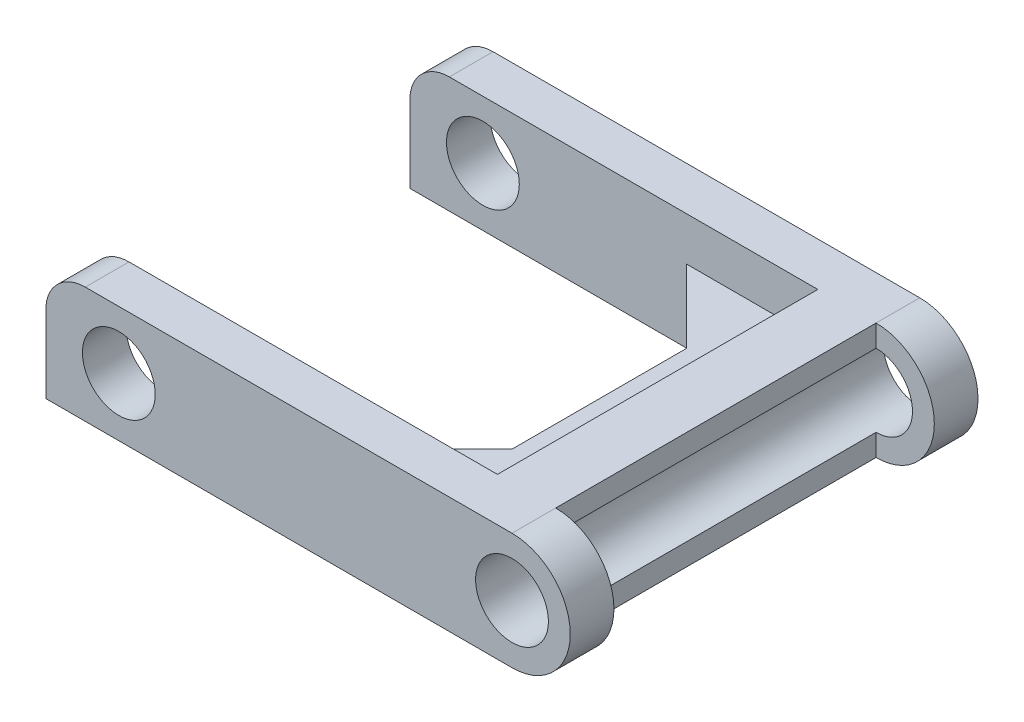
from build123d import *

# Parameters (mm, degrees)
EXTRUDE1_DEPTH    = 14
SKETCH6_R         = 1.25
SKETCH6_R_2       = 1.249999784
EXTRUDE2_DEPTH    = 122.095272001
SKETCH7_OUTSIDE_W = 24.639
SKETCH7_OUTSIDE_H = 20.632
EXTRUDE3_DEPTH    = 117.014475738
EXTRUDE4_START    = -17.03965
EXTRUDE4_DEPTH    = 1


with BuildPart() as part:
    # Sketch5 → Extrude1 (new body)
    with BuildSketch(Plane.XY):
        with BuildLine():
            Line((111.496962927, 39.830945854), (96.846962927, 39.823427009))
            ThreePointArc((96.846962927, 39.823427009), (95.840961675, 39.376588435), (95.496963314, 38.330945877))
            Line((95.496963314, 38.330945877), (95.496963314, 35.830945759))
            Line((95.496963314, 35.830945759), (111.496963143, 35.830945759))
            ThreePointArc((111.496963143, 35.830945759), (113.49696319, 37.830945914), (111.496962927, 39.830945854))
        make_face()
    extrude(amount=-EXTRUDE1_DEPTH)

    # Sketch6 → Extrude2 (cut, through all)
    with BuildSketch(Plane.XY):
        with Locations((97.996962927, 37.830945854)):
            Circle(SKETCH6_R)
        with Locations((111.496963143, 37.830945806)):
            Circle(SKETCH6_R_2)
    extrude(amount=-EXTRUDE2_DEPTH, mode=Mode.SUBTRACT)

    # Sketch7 outside → Extrude3 (cut, through all)
    with BuildSketch(Plane(origin=(0, 55.370595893, 0), x_dir=(-1, 0, 0), z_dir=(0, 1, 0))):
        with Locations((-104.4935, -7)):
            Rectangle(SKETCH7_OUTSIDE_W, SKETCH7_OUTSIDE_H)
        Polygon((-104.99696294, -12.500000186), (-95.496963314, -12.500000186), (-95.496963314, -14.000000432), (-113.496962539, -14.000000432), (-113.496962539, -12.500000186), (-111.496963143, -12.500000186), (-111.496963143, -1.500000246), (-113.496962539, -1.500000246), (-113.496962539, 0), (-95.496963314, 0), (-95.496963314, -1.500000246), (-104.99696294, -1.500000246), (-109.496962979, -1.500000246), (-109.496962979, -12.500000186), align=None, mode=Mode.SUBTRACT)
    extrude(amount=-EXTRUDE3_DEPTH, mode=Mode.SUBTRACT)

    # Sketch8 → Extrude4 (add)
    with BuildSketch(Plane(origin=(0, 55.370595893, 0), x_dir=(-1, 0, 0), z_dir=(0, 1, 0)).offset(EXTRUDE4_START)):
        Polygon((-104.99696294, -1.500000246), (-107.496963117, -4.00000019), (-107.496963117, -10.000000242), (-104.99696294, -12.500000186), (-109.496962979, -12.500000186), (-109.496962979, -1.500000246), align=None)
    extrude(amount=-EXTRUDE4_DEPTH)


solid = part.part
